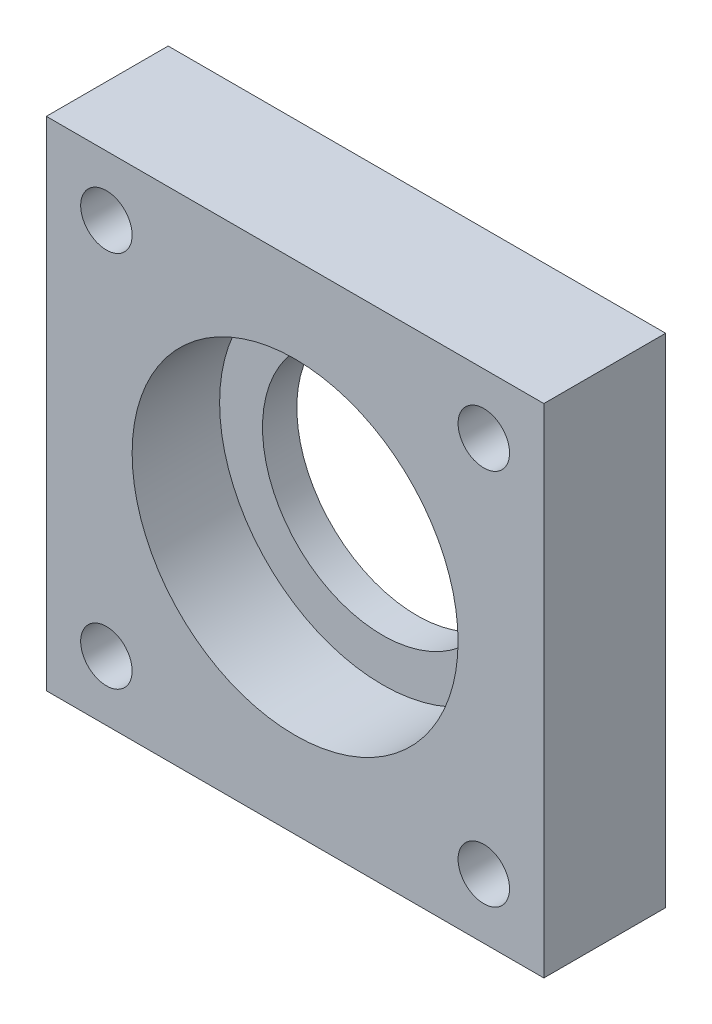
from build123d import *

# Parameters (mm, degrees)
SKETCH_1_W          = 29
SKETCH_1_H          = 29
SKETCH_1_R          = 9.5
EXTRUDE_2_DEPTH     = 5.1
EXTRUDE_START       = -2
SKETCH_1_8_W        = 29
SKETCH_1_8_H        = 29
SKETCH_1_8_R        = 9.5
SKETCH_1_8_R_2      = 7
EXTRUDE_3_DEPTH     = 2
SKETCH_3_R          = 1.5
CUT_EXTRUDE_1_DEPTH = 7.1
CUT_EXTRUDE_START   = -2
SKETCH_5_R          = 1.5
CUT_EXTRUDE_2_DEPTH = 2


with BuildPart() as part:
    # Sketch 1 → Extrude 2 (new body)
    with BuildSketch(Plane.XY):
        with Locations((-7.623161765, -5.224264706)):
            Rectangle(SKETCH_1_W, SKETCH_1_H)
        with Locations((-7.623161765, -5.224264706)):
            Circle(SKETCH_1_R, mode=Mode.SUBTRACT)
    extrude(amount=EXTRUDE_2_DEPTH)

    # Sketch 1_8 → Extrude 3 (add)
    # profile 1 of 2: a face of its own
    with BuildSketch(Plane.XY.offset(EXTRUDE_START)):
        with Locations((-7.623161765, -5.224264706)):
            Rectangle(SKETCH_1_8_W, SKETCH_1_8_H)
        with Locations((-7.623161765, -5.224264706)):
            Circle(SKETCH_1_8_R, mode=Mode.SUBTRACT)
    # profile 2 of 2: a face of its own
    with BuildSketch(Plane.XY.offset(EXTRUDE_START)):
        with Locations((-7.623161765, -5.224264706)):
            Circle(SKETCH_1_8_R)
        with Locations((-7.623161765, -5.224264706)):
            Circle(SKETCH_1_8_R_2, mode=Mode.SUBTRACT)
    extrude(amount=EXTRUDE_3_DEPTH)

    # Sketch 3 → Cut-Extrude 1 (cut)
    with BuildSketch(Plane.XY.offset(5.1)):
        with Locations((-18.623161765, 5.775735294)):
            Circle(SKETCH_3_R)
        with Locations((3.376838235, 5.775735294)):
            Circle(SKETCH_3_R)
        with Locations((3.376838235, -16.224264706)):
            Circle(SKETCH_3_R)
        with Locations((-18.623161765, -16.224264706)):
            Circle(SKETCH_3_R)
    extrude(amount=-CUT_EXTRUDE_1_DEPTH, mode=Mode.SUBTRACT)

    # Sketch 5 → Cut-Extrude 2 (cut)
    # profile 1 of 4: a face of its own
    with BuildSketch(Plane(origin=(0, 0, -2), x_dir=(-1, 0, 0), z_dir=(0, 0, -1)).offset(CUT_EXTRUDE_START)):
        Polygon((-6.176838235, 7.616396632), (-3.376838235, 8.825735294), (-0.576838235, 7.616396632), (-0.576838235, 3.935073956), (-3.376838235, 2.725735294), (-6.176838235, 3.935073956), align=None)
        with Locations(Location((-3.376838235, 5.775735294, 0), (0, 0, 180))):
            Circle(SKETCH_5_R, mode=Mode.SUBTRACT)
    # profile 2 of 4: a face of its own
    with BuildSketch(Plane(origin=(0, 0, -2), x_dir=(-1, 0, 0), z_dir=(0, 0, -1)).offset(CUT_EXTRUDE_START)):
        Polygon((15.823161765, 7.616396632), (18.623161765, 8.825735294), (21.423161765, 7.616396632), (21.423161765, 3.935073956), (18.623161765, 2.725735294), (15.823161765, 3.935073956), align=None)
        with Locations(Location((18.623161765, 5.775735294, 0), (0, 0, 180))):
            Circle(SKETCH_5_R, mode=Mode.SUBTRACT)
    # profile 3 of 4: a face of its own
    with BuildSketch(Plane(origin=(0, 0, -2), x_dir=(-1, 0, 0), z_dir=(0, 0, -1)).offset(CUT_EXTRUDE_START)):
        Polygon((15.823161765, -14.383603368), (18.623161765, -13.174264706), (21.423161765, -14.383603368), (21.423161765, -18.064926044), (18.623161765, -19.274264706), (15.823161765, -18.064926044), align=None)
        with Locations(Location((18.623161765, -16.224264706, 0), (0, 0, 180))):
            Circle(SKETCH_5_R, mode=Mode.SUBTRACT)
    # profile 4 of 4: a face of its own
    with BuildSketch(Plane(origin=(0, 0, -2), x_dir=(-1, 0, 0), z_dir=(0, 0, -1)).offset(CUT_EXTRUDE_START)):
        Polygon((-6.176838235, -14.383603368), (-3.376838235, -13.174264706), (-0.576838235, -14.383603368), (-0.576838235, -18.064926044), (-3.376838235, -19.274264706), (-6.176838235, -18.064926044), align=None)
        with Locations(Location((-3.376838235, -16.224264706, 0), (0, 0, 180))):
            Circle(SKETCH_5_R, mode=Mode.SUBTRACT)
    extrude(amount=CUT_EXTRUDE_2_DEPTH, mode=Mode.SUBTRACT)


solid = part.part
